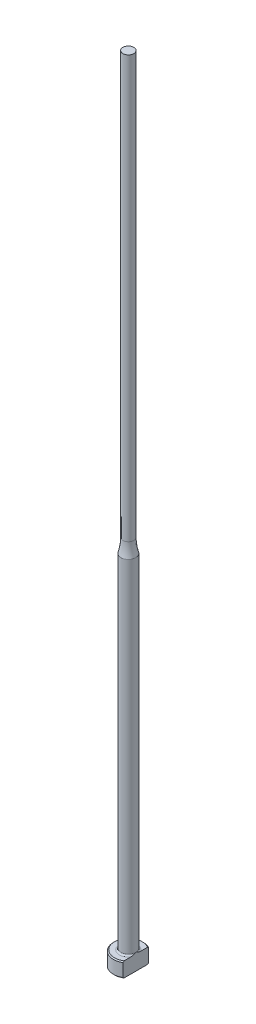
ISO-10303-21;
HEADER;
FILE_DESCRIPTION(('STEP AP214'),'2;1');
FILE_NAME('part.step','',(''),(''),'','','');
FILE_SCHEMA(('AUTOMOTIVE_DESIGN { 1 0 10303 214 1 1 1 1 }'));
ENDSEC;
DATA;
#1=APPLICATION_CONTEXT('core data for automotive mechanical design processes');
#2=APPLICATION_PROTOCOL_DEFINITION('international standard','automotive_design',2000,#1);
#3=PRODUCT_CONTEXT('',#1,'mechanical');
#4=PRODUCT('Part','Part','',(#3));
#5=PRODUCT_RELATED_PRODUCT_CATEGORY('part','',(#4));
#6=PRODUCT_DEFINITION_FORMATION('','',#4);
#7=PRODUCT_DEFINITION_CONTEXT('part definition',#1,'design');
#8=PRODUCT_DEFINITION('design','',#6,#7);
#9=PRODUCT_DEFINITION_SHAPE('','',#8);
#10=(LENGTH_UNIT() NAMED_UNIT(*) SI_UNIT(.MILLI.,.METRE.));
#11=(NAMED_UNIT(*) PLANE_ANGLE_UNIT() SI_UNIT($,.RADIAN.));
#12=(NAMED_UNIT(*) SI_UNIT($,.STERADIAN.) SOLID_ANGLE_UNIT());
#13=UNCERTAINTY_MEASURE_WITH_UNIT(LENGTH_MEASURE(1.E-05),#10,'distance_accuracy_value','');
#14=(GEOMETRIC_REPRESENTATION_CONTEXT(3) GLOBAL_UNCERTAINTY_ASSIGNED_CONTEXT((#13)) GLOBAL_UNIT_ASSIGNED_CONTEXT((#10,
#11,#12)) REPRESENTATION_CONTEXT('',''));
#15=CARTESIAN_POINT('',(0.,0.,0.));
#16=DIRECTION('',(0.,0.,1.));
#17=DIRECTION('',(1.,0.,0.));
#18=AXIS2_PLACEMENT_3D('',#15,#16,#17);
#19=CARTESIAN_POINT('',(-2.99999999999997,3.,0.));
#20=DIRECTION('',(0.,1.,0.));
#21=DIRECTION('',(0.,0.,1.));
#22=AXIS2_PLACEMENT_3D('',#19,#20,#21);
#23=PLANE('',#22);
#24=CARTESIAN_POINT('',(0.,3.,0.));
#25=DIRECTION('',(0.,1.,0.));
#26=DIRECTION('',(0.,0.,1.));
#27=AXIS2_PLACEMENT_3D('',#24,#25,#26);
#28=CIRCLE('',#27,2.79999999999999);
#29=CARTESIAN_POINT('',(1.49999999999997,3.,-2.36431808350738));
#30=VERTEX_POINT('',#29);
#31=CARTESIAN_POINT('',(1.49999999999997,3.,2.36431808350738));
#32=VERTEX_POINT('',#31);
#33=EDGE_CURVE('E187',#30,#32,#28,.T.);
#34=ORIENTED_EDGE('',*,*,#33,.T.);
#35=DIRECTION('',(0.,0.,-1.));
#36=VECTOR('',#35,1.);
#37=CARTESIAN_POINT('',(1.49999999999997,3.,0.));
#38=LINE('',#37,#36);
#39=CARTESIAN_POINT('',(1.49999999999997,3.00000000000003,0.99498743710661));
#40=VERTEX_POINT('',#39);
#41=EDGE_CURVE('E57',#32,#40,#38,.T.);
#42=ORIENTED_EDGE('',*,*,#41,.T.);
#43=CARTESIAN_POINT('',(0.,3.,0.));
#44=DIRECTION('',(0.,1.,0.));
#45=DIRECTION('',(0.,0.,1.));
#46=AXIS2_PLACEMENT_3D('',#43,#44,#45);
#47=CIRCLE('',#46,1.79999999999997);
#48=CARTESIAN_POINT('',(1.49999999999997,3.00000000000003,-0.994987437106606));
#49=VERTEX_POINT('',#48);
#50=EDGE_CURVE('E108',#40,#49,#47,.F.);
#51=ORIENTED_EDGE('',*,*,#50,.T.);
#52=EDGE_CURVE('E137',#49,#30,#38,.T.);
#53=ORIENTED_EDGE('',*,*,#52,.T.);
#54=EDGE_LOOP('',(#34,#42,#51,#53));
#55=FACE_BOUND('',#54,.T.);
#56=ADVANCED_FACE('F32',(#55),#23,.T.);
#57=CARTESIAN_POINT('',(0.,259.958771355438,0.));
#58=DIRECTION('',(0.,1.,0.));
#59=DIRECTION('',(0.,0.,1.));
#60=AXIS2_PLACEMENT_3D('',#57,#58,#59);
#61=CYLINDRICAL_SURFACE('',#60,2.99999999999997);
#62=CARTESIAN_POINT('',(0.,2.80000000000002,0.));
#63=DIRECTION('',(0.,1.,0.));
#64=DIRECTION('',(0.,0.,1.));
#65=AXIS2_PLACEMENT_3D('',#62,#63,#64);
#66=CIRCLE('',#65,2.99999999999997);
#67=CARTESIAN_POINT('',(1.49999999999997,2.80000000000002,2.5980762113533));
#68=VERTEX_POINT('',#67);
#69=CARTESIAN_POINT('',(1.49999999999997,2.80000000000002,-2.5980762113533));
#70=VERTEX_POINT('',#69);
#71=EDGE_CURVE('E105',#68,#70,#66,.F.);
#72=ORIENTED_EDGE('',*,*,#71,.T.);
#73=DIRECTION('',(0.,-1.,0.));
#74=VECTOR('',#73,1.);
#75=CARTESIAN_POINT('',(1.49999999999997,160.,-2.5980762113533));
#76=LINE('',#75,#74);
#77=CARTESIAN_POINT('',(1.49999999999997,0.200000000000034,-2.5980762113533));
#78=VERTEX_POINT('',#77);
#79=EDGE_CURVE('E193',#70,#78,#76,.T.);
#80=ORIENTED_EDGE('',*,*,#79,.T.);
#81=CARTESIAN_POINT('',(0.,0.200000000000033,0.));
#82=DIRECTION('',(0.,-1.,0.));
#83=DIRECTION('',(0.,0.,-1.));
#84=AXIS2_PLACEMENT_3D('',#81,#82,#83);
#85=CIRCLE('',#84,2.99999999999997);
#86=CARTESIAN_POINT('',(1.49999999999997,0.200000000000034,2.5980762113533));
#87=VERTEX_POINT('',#86);
#88=EDGE_CURVE('E100',#78,#87,#85,.F.);
#89=ORIENTED_EDGE('',*,*,#88,.T.);
#90=DIRECTION('',(0.,-1.,0.));
#91=VECTOR('',#90,1.);
#92=CARTESIAN_POINT('',(1.49999999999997,160.,2.5980762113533));
#93=LINE('',#92,#91);
#94=EDGE_CURVE('E93',#68,#87,#93,.T.);
#95=ORIENTED_EDGE('',*,*,#94,.F.);
#96=EDGE_LOOP('',(#72,#80,#89,#95));
#97=FACE_BOUND('',#96,.T.);
#98=ADVANCED_FACE('F158',(#97),#61,.T.);
#99=CARTESIAN_POINT('',(0.,0.,0.));
#100=DIRECTION('',(0.,-1.,0.));
#101=DIRECTION('',(0.,0.,-1.));
#102=AXIS2_PLACEMENT_3D('',#99,#100,#101);
#103=PLANE('',#102);
#104=CARTESIAN_POINT('',(0.,0.,0.));
#105=DIRECTION('',(0.,-1.,0.));
#106=DIRECTION('',(0.,0.,-1.));
#107=AXIS2_PLACEMENT_3D('',#104,#105,#106);
#108=CIRCLE('',#107,2.79999999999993);
#109=CARTESIAN_POINT('',(1.49999999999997,0.,2.36431808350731));
#110=VERTEX_POINT('',#109);
#111=CARTESIAN_POINT('',(1.49999999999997,0.,-2.36431808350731));
#112=VERTEX_POINT('',#111);
#113=EDGE_CURVE('E98',#110,#112,#108,.T.);
#114=ORIENTED_EDGE('',*,*,#113,.T.);
#115=DIRECTION('',(0.,0.,1.));
#116=VECTOR('',#115,1.);
#117=CARTESIAN_POINT('',(1.49999999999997,0.,-2.5980762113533));
#118=LINE('',#117,#116);
#119=EDGE_CURVE('E83',#112,#110,#118,.T.);
#120=ORIENTED_EDGE('',*,*,#119,.T.);
#121=EDGE_LOOP('',(#114,#120));
#122=FACE_BOUND('',#121,.T.);
#123=ADVANCED_FACE('F103',(#122),#103,.T.);
#124=CARTESIAN_POINT('',(0.,3.,0.));
#125=DIRECTION('',(0.,-1.,0.));
#126=DIRECTION('',(0.,0.,-1.));
#127=AXIS2_PLACEMENT_3D('',#124,#125,#126);
#128=CONICAL_SURFACE('',#127,2.79999999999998,0.785398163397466);
#129=ORIENTED_EDGE('',*,*,#71,.F.);
#130=CARTESIAN_POINT('',(1.49999999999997,-0.111741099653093,5.71827621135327));
#131=CARTESIAN_POINT('',(1.49999999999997,0.0136183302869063,5.58866816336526));
#132=CARTESIAN_POINT('',(1.49999999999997,0.138843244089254,5.45892957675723));
#133=CARTESIAN_POINT('',(1.49999999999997,0.388944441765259,5.19911365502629));
#134=CARTESIAN_POINT('',(1.49999999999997,0.513820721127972,5.06903631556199));
#135=CARTESIAN_POINT('',(1.49999999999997,0.763205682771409,4.80840180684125));
#136=CARTESIAN_POINT('',(1.49999999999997,0.887714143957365,4.67784442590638));
#137=CARTESIAN_POINT('',(1.49999999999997,1.13618059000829,4.41620813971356));
#138=CARTESIAN_POINT('',(1.49999999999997,1.26013857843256,4.28512923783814));
#139=CARTESIAN_POINT('',(1.49999999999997,1.50488975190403,4.02490837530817));
#140=CARTESIAN_POINT('',(1.49999999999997,1.6256969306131,3.89577958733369));
#141=CARTESIAN_POINT('',(1.49999999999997,1.86640694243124,3.63668213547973));
#142=CARTESIAN_POINT('',(1.49999999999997,1.98630978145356,3.50671347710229));
#143=CARTESIAN_POINT('',(1.49999999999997,2.22486033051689,3.24567921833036));
#144=CARTESIAN_POINT('',(1.49999999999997,2.34350830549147,3.11461386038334));
#145=CARTESIAN_POINT('',(1.49999999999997,2.57907716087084,2.85094268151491));
#146=CARTESIAN_POINT('',(1.49999999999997,2.69599811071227,2.71833692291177));
#147=CARTESIAN_POINT('',(1.49999999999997,2.88262371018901,2.50255231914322));
#148=CARTESIAN_POINT('',(1.49999999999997,2.95312454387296,2.42006293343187));
#149=CARTESIAN_POINT('',(1.49999999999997,3.0928709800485,2.25401084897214));
#150=CARTESIAN_POINT('',(1.49999999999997,3.16211645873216,2.17044804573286));
#151=CARTESIAN_POINT('',(1.49999999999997,3.29964684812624,2.00105967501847));
#152=CARTESIAN_POINT('',(1.49999999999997,3.36791386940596,1.91521952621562));
#153=CARTESIAN_POINT('',(1.49999999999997,3.50205840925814,1.74171392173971));
#154=CARTESIAN_POINT('',(1.49999999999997,3.56793649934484,1.65404891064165));
#155=CARTESIAN_POINT('',(1.49999999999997,3.69728151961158,1.47490236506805));
#156=CARTESIAN_POINT('',(1.49999999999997,3.76069661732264,1.38338308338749));
#157=CARTESIAN_POINT('',(1.49999999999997,3.8823953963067,1.19675661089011));
#158=CARTESIAN_POINT('',(1.49999999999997,3.94067201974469,1.10164473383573));
#159=CARTESIAN_POINT('',(1.49999999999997,4.04841325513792,0.908008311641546));
#160=CARTESIAN_POINT('',(1.49999999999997,4.0979780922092,0.809540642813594));
#161=CARTESIAN_POINT('',(1.49999999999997,4.18432188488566,0.607192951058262));
#162=CARTESIAN_POINT('',(1.49999999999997,4.22114374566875,0.503332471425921));
#163=CARTESIAN_POINT('',(1.49999999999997,4.26099935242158,0.347577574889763));
#164=CARTESIAN_POINT('',(1.49999999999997,4.27157029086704,0.297609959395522));
#165=CARTESIAN_POINT('',(1.49999999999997,4.28794860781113,0.196885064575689));
#166=CARTESIAN_POINT('',(1.49999999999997,4.29375640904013,0.146127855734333));
#167=CARTESIAN_POINT('',(1.49999999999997,4.30019707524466,0.0444388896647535));
#168=CARTESIAN_POINT('',(1.49999999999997,4.30084594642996,-0.00649183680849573));
#169=CARTESIAN_POINT('',(1.49999999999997,4.29696416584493,-0.108155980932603));
#170=CARTESIAN_POINT('',(1.49999999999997,4.29243308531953,-0.15888938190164));
#171=CARTESIAN_POINT('',(1.49999999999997,4.27856915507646,-0.259234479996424));
#172=CARTESIAN_POINT('',(1.49999999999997,4.26927821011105,-0.30885208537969));
#173=CARTESIAN_POINT('',(1.49999999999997,4.24647108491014,-0.407110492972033));
#174=CARTESIAN_POINT('',(1.49999999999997,4.2329532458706,-0.455750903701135));
#175=CARTESIAN_POINT('',(1.49999999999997,4.20226175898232,-0.552149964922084));
#176=CARTESIAN_POINT('',(1.49999999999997,4.18506801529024,-0.599902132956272));
#177=CARTESIAN_POINT('',(1.49999999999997,4.14771387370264,-0.694205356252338));
#178=CARTESIAN_POINT('',(1.49999999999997,4.1275540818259,-0.740756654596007));
#179=CARTESIAN_POINT('',(1.49999999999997,4.06327696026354,-0.879166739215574));
#180=CARTESIAN_POINT('',(1.49999999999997,4.01551721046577,-0.969329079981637));
#181=CARTESIAN_POINT('',(1.49999999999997,3.91367909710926,-1.1460431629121));
#182=CARTESIAN_POINT('',(1.49999999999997,3.85959300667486,-1.23259031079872));
#183=CARTESIAN_POINT('',(1.49999999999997,3.74697968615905,-1.40321348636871));
#184=CARTESIAN_POINT('',(1.49999999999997,3.68843573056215,-1.48727838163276));
#185=CARTESIAN_POINT('',(1.49999999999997,3.56843845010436,-1.65322187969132));
#186=CARTESIAN_POINT('',(1.49999999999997,3.50698656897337,-1.73510153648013));
#187=CARTESIAN_POINT('',(1.49999999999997,3.38115673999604,-1.89829823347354));
#188=CARTESIAN_POINT('',(1.49999999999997,3.31675092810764,-1.97959369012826));
#189=CARTESIAN_POINT('',(1.49999999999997,3.18634068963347,-2.14090082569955));
#190=CARTESIAN_POINT('',(1.49999999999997,3.12033609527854,-2.22091236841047));
#191=CARTESIAN_POINT('',(1.49999999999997,2.92086431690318,-2.45906508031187));
#192=CARTESIAN_POINT('',(1.49999999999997,2.78562663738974,-2.61572090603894));
#193=CARTESIAN_POINT('',(1.49999999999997,2.53554498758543,-2.90006295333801));
#194=CARTESIAN_POINT('',(1.49999999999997,2.42114543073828,-3.02814382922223));
#195=CARTESIAN_POINT('',(1.49999999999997,2.19093557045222,-3.28303767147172));
#196=CARTESIAN_POINT('',(1.49999999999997,2.07512522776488,-3.40985060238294));
#197=CARTESIAN_POINT('',(1.49999999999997,1.72597067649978,-3.7891384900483));
#198=CARTESIAN_POINT('',(1.49999999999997,1.49111760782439,-4.04022177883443));
#199=CARTESIAN_POINT('',(1.49999999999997,1.02882478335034,-4.52992803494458));
#200=CARTESIAN_POINT('',(1.49999999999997,0.801477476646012,-4.76863870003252));
#201=CARTESIAN_POINT('',(1.49999999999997,0.459548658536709,-5.12558036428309));
#202=CARTESIAN_POINT('',(1.49999999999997,0.345484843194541,-5.2443077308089));
#203=CARTESIAN_POINT('',(1.49999999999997,0.117071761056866,-5.48148573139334));
#204=CARTESIAN_POINT('',(1.49999999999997,0.00272249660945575,-5.59993636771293));
#205=CARTESIAN_POINT('',(1.49999999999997,-0.111741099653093,-5.71827621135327));
#206=B_SPLINE_CURVE_WITH_KNOTS('',3,(#130,#131,#132,#133,#134,#135,#136,#137,#138,#139,#140,
#141,#142,#143,#144,#145,#146,#147,#148,#149,#150,#151,#152,#153,#154,#155,#156,#157,#158,#159,
#160,#161,#162,#163,#164,#165,#166,#167,#168,#169,#170,#171,#172,#173,#174,#175,#176,#177,#178,
#179,#180,#181,#182,#183,#184,#185,#186,#187,#188,#189,#190,#191,#192,#193,#194,#195,#196,#197,
#198,#199,#200,#201,#202,#203,#204,#205),.UNSPECIFIED.,.F.,.F.,(4,2,2,2,2,2,2,2,2,2,2,2,2,2,2,2,
2,2,2,2,2,2,2,2,2,2,2,2,2,2,2,2,2,2,2,2,2,4),(0.,0.540943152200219,1.08189327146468,
1.62312052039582,2.16434426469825,2.69482920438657,3.22531067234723,3.75567781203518,
4.2860235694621,4.61155053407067,4.93710943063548,5.2661094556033,5.59503024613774,
5.92894782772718,6.26331713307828,6.59354403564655,6.92264800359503,7.0756747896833,
7.22868799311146,7.38122626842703,7.53377717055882,7.68500755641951,7.83629736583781,
7.98843643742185,8.14054446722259,8.44618799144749,8.75220879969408,9.05944044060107,
9.36652111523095,9.67764287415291,9.98879742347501,10.6095925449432,11.1247803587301,
11.6399825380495,12.6713544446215,13.6603005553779,14.1542238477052,14.6481430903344),.UNSPECIFIED.);
#207=EDGE_CURVE('E136',#68,#32,#206,.T.);
#208=ORIENTED_EDGE('',*,*,#207,.T.);
#209=ORIENTED_EDGE('',*,*,#33,.F.);
#210=EDGE_CURVE('E128',#30,#70,#206,.T.);
#211=ORIENTED_EDGE('',*,*,#210,.T.);
#212=EDGE_LOOP('',(#129,#208,#209,#211));
#213=FACE_BOUND('',#212,.T.);
#214=ADVANCED_FACE('F144',(#213),#128,.T.);
#215=CARTESIAN_POINT('',(0.,0.200000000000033,0.));
#216=DIRECTION('',(0.,1.,0.));
#217=DIRECTION('',(0.,0.,1.));
#218=AXIS2_PLACEMENT_3D('',#215,#216,#217);
#219=CONICAL_SURFACE('',#218,2.99999999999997,0.785398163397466);
#220=ORIENTED_EDGE('',*,*,#88,.F.);
#221=CARTESIAN_POINT('',(1.49999999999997,3.11174109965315,-5.71827621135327));
#222=CARTESIAN_POINT('',(1.49999999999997,2.98638166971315,-5.58866816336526));
#223=CARTESIAN_POINT('',(1.49999999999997,2.8611567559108,-5.45892957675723));
#224=CARTESIAN_POINT('',(1.49999999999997,2.6110555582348,-5.19911365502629));
#225=CARTESIAN_POINT('',(1.49999999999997,2.48617927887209,-5.06903631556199));
#226=CARTESIAN_POINT('',(1.49999999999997,2.23679431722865,-4.80840180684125));
#227=CARTESIAN_POINT('',(1.49999999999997,2.11228585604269,-4.67784442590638));
#228=CARTESIAN_POINT('',(1.49999999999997,1.86381940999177,-4.41620813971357));
#229=CARTESIAN_POINT('',(1.49999999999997,1.7398614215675,-4.28512923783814));
#230=CARTESIAN_POINT('',(1.49999999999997,1.49511024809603,-4.02490837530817));
#231=CARTESIAN_POINT('',(1.49999999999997,1.37430306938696,-3.89577958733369));
#232=CARTESIAN_POINT('',(1.49999999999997,1.13359305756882,-3.63668213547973));
#233=CARTESIAN_POINT('',(1.49999999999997,1.0136902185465,-3.50671347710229));
#234=CARTESIAN_POINT('',(1.49999999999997,0.775139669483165,-3.24567921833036));
#235=CARTESIAN_POINT('',(1.49999999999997,0.656491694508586,-3.11461386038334));
#236=CARTESIAN_POINT('',(1.49999999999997,0.420922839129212,-2.85094268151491));
#237=CARTESIAN_POINT('',(1.49999999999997,0.304001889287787,-2.71833692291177));
#238=CARTESIAN_POINT('',(1.49999999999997,0.117376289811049,-2.50255231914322));
#239=CARTESIAN_POINT('',(1.49999999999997,0.0468754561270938,-2.42006293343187));
#240=CARTESIAN_POINT('',(1.49999999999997,-0.0928709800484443,-2.25401084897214));
#241=CARTESIAN_POINT('',(1.49999999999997,-0.162116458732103,-2.17044804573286));
#242=CARTESIAN_POINT('',(1.49999999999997,-0.299646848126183,-2.00105967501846));
#243=CARTESIAN_POINT('',(1.49999999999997,-0.367913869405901,-1.91521952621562));
#244=CARTESIAN_POINT('',(1.49999999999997,-0.502058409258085,-1.74171392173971));
#245=CARTESIAN_POINT('',(1.49999999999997,-0.567936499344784,-1.65404891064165));
#246=CARTESIAN_POINT('',(1.49999999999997,-0.697281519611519,-1.47490236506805));
#247=CARTESIAN_POINT('',(1.49999999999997,-0.760696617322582,-1.38338308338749));
#248=CARTESIAN_POINT('',(1.49999999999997,-0.882395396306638,-1.19675661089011));
#249=CARTESIAN_POINT('',(1.49999999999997,-0.940672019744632,-1.10164473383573));
#250=CARTESIAN_POINT('',(1.49999999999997,-1.04841325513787,-0.908008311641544));
#251=CARTESIAN_POINT('',(1.49999999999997,-1.09797809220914,-0.809540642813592));
#252=CARTESIAN_POINT('',(1.49999999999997,-1.1843218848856,-0.60719295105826));
#253=CARTESIAN_POINT('',(1.49999999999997,-1.22114374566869,-0.503332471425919));
#254=CARTESIAN_POINT('',(1.49999999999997,-1.26099935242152,-0.347577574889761));
#255=CARTESIAN_POINT('',(1.49999999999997,-1.27157029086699,-0.29760995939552));
#256=CARTESIAN_POINT('',(1.49999999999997,-1.28794860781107,-0.196885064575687));
#257=CARTESIAN_POINT('',(1.49999999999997,-1.29375640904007,-0.146127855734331));
#258=CARTESIAN_POINT('',(1.49999999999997,-1.30019707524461,-0.0444388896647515));
#259=CARTESIAN_POINT('',(1.49999999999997,-1.3008459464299,0.00649183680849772));
#260=CARTESIAN_POINT('',(1.49999999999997,-1.29696416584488,0.108155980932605));
#261=CARTESIAN_POINT('',(1.49999999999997,-1.29243308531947,0.158889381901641));
#262=CARTESIAN_POINT('',(1.49999999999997,-1.2785691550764,0.259234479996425));
#263=CARTESIAN_POINT('',(1.49999999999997,-1.26927821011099,0.308852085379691));
#264=CARTESIAN_POINT('',(1.49999999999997,-1.24647108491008,0.407110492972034));
#265=CARTESIAN_POINT('',(1.49999999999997,-1.23295324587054,0.455750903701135));
#266=CARTESIAN_POINT('',(1.49999999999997,-1.20226175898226,0.552149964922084));
#267=CARTESIAN_POINT('',(1.49999999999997,-1.18506801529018,0.599902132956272));
#268=CARTESIAN_POINT('',(1.49999999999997,-1.14771387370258,0.694205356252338));
#269=CARTESIAN_POINT('',(1.49999999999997,-1.12755408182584,0.740756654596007));
#270=CARTESIAN_POINT('',(1.49999999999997,-1.06327696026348,0.879166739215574));
#271=CARTESIAN_POINT('',(1.49999999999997,-1.01551721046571,0.969329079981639));
#272=CARTESIAN_POINT('',(1.49999999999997,-0.913679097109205,1.1460431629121));
#273=CARTESIAN_POINT('',(1.49999999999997,-0.8595930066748,1.23259031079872));
#274=CARTESIAN_POINT('',(1.49999999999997,-0.746979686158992,1.40321348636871));
#275=CARTESIAN_POINT('',(1.49999999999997,-0.688435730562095,1.48727838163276));
#276=CARTESIAN_POINT('',(1.49999999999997,-0.568438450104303,1.65322187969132));
#277=CARTESIAN_POINT('',(1.49999999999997,-0.506986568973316,1.73510153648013));
#278=CARTESIAN_POINT('',(1.49999999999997,-0.381156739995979,1.89829823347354));
#279=CARTESIAN_POINT('',(1.49999999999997,-0.316750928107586,1.97959369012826));
#280=CARTESIAN_POINT('',(1.49999999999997,-0.186340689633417,2.14090082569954));
#281=CARTESIAN_POINT('',(1.49999999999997,-0.120336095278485,2.22091236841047));
#282=CARTESIAN_POINT('',(1.49999999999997,0.0791356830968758,2.45906508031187));
#283=CARTESIAN_POINT('',(1.49999999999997,0.214373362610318,2.61572090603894));
#284=CARTESIAN_POINT('',(1.49999999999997,0.46445501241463,2.90006295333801));
#285=CARTESIAN_POINT('',(1.49999999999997,0.578854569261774,3.02814382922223));
#286=CARTESIAN_POINT('',(1.49999999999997,0.809064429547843,3.28303767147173));
#287=CARTESIAN_POINT('',(1.49999999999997,0.924874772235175,3.40985060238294));
#288=CARTESIAN_POINT('',(1.49999999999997,1.27402932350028,3.78913849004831));
#289=CARTESIAN_POINT('',(1.49999999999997,1.50888239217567,4.04022177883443));
#290=CARTESIAN_POINT('',(1.49999999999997,1.97117521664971,4.52992803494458));
#291=CARTESIAN_POINT('',(1.49999999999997,2.19852252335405,4.76863870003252));
#292=CARTESIAN_POINT('',(1.49999999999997,2.54045134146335,5.12558036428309));
#293=CARTESIAN_POINT('',(1.49999999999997,2.65451515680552,5.2443077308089));
#294=CARTESIAN_POINT('',(1.49999999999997,2.88292823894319,5.48148573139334));
#295=CARTESIAN_POINT('',(1.49999999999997,2.9972775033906,5.59993636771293));
#296=CARTESIAN_POINT('',(1.49999999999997,3.11174109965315,5.71827621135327));
#297=B_SPLINE_CURVE_WITH_KNOTS('',3,(#221,#222,#223,#224,#225,#226,#227,#228,#229,#230,#231,
#232,#233,#234,#235,#236,#237,#238,#239,#240,#241,#242,#243,#244,#245,#246,#247,#248,#249,#250,
#251,#252,#253,#254,#255,#256,#257,#258,#259,#260,#261,#262,#263,#264,#265,#266,#267,#268,#269,
#270,#271,#272,#273,#274,#275,#276,#277,#278,#279,#280,#281,#282,#283,#284,#285,#286,#287,#288,
#289,#290,#291,#292,#293,#294,#295,#296),.UNSPECIFIED.,.F.,.F.,(4,2,2,2,2,2,2,2,2,2,2,2,2,2,2,2,
2,2,2,2,2,2,2,2,2,2,2,2,2,2,2,2,2,2,2,2,2,4),(0.,0.540943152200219,1.08189327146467,
1.62312052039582,2.16434426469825,2.69482920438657,3.22531067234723,3.75567781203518,
4.28602356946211,4.61155053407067,4.93710943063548,5.2661094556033,5.59503024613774,
5.92894782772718,6.26331713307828,6.59354403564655,6.92264800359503,7.0756747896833,
7.22868799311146,7.38122626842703,7.53377717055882,7.68500755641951,7.83629736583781,
7.98843643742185,8.14054446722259,8.4461879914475,8.75220879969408,9.05944044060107,
9.36652111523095,9.6776428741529,9.98879742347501,10.6095925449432,11.1247803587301,
11.6399825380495,12.6713544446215,13.6603005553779,14.1542238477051,14.6481430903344),.UNSPECIFIED.);
#298=EDGE_CURVE('E86',#78,#112,#297,.T.);
#299=ORIENTED_EDGE('',*,*,#298,.T.);
#300=ORIENTED_EDGE('',*,*,#113,.F.);
#301=EDGE_CURVE('E89',#110,#87,#297,.T.);
#302=ORIENTED_EDGE('',*,*,#301,.T.);
#303=EDGE_LOOP('',(#220,#299,#300,#302));
#304=FACE_BOUND('',#303,.T.);
#305=ADVANCED_FACE('F97',(#304),#219,.T.);
#306=CARTESIAN_POINT('',(0.,3.30000000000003,0.));
#307=DIRECTION('',(0.,1.,0.));
#308=DIRECTION('',(0.,0.,1.));
#309=AXIS2_PLACEMENT_3D('',#306,#307,#308);
#310=TOROIDAL_SURFACE('',#309,1.79999999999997,0.3);
#311=CARTESIAN_POINT('',(1.49999999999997,3.30000000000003,0.));
#312=CARTESIAN_POINT('',(1.49999999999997,3.300000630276,3.41555678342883E-12));
#313=CARTESIAN_POINT('',(1.49999999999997,3.30000126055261,-1.15373640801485E-07));
#314=CARTESIAN_POINT('',(1.49999999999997,3.3000024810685,-4.90631575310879E-07));
#315=CARTESIAN_POINT('',(1.49999999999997,3.30000307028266,-7.53296670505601E-07));
#316=CARTESIAN_POINT('',(1.49999999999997,3.30000424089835,-1.38757096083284E-06));
#317=CARTESIAN_POINT('',(1.49999999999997,3.300004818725,-1.76563001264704E-06));
#318=CARTESIAN_POINT('',(1.49999999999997,3.30000591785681,-2.58768006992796E-06));
#319=CARTESIAN_POINT('',(1.49999999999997,3.30000643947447,-3.03127014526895E-06));
#320=CARTESIAN_POINT('',(1.49999999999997,3.30000815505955,-4.60021967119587E-06));
#321=CARTESIAN_POINT('',(1.49999999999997,3.30000927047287,-5.8124152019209E-06));
#322=CARTESIAN_POINT('',(1.49999999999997,3.30001128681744,-8.33989413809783E-06));
#323=CARTESIAN_POINT('',(1.49999999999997,3.30001219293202,-9.65128157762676E-06));
#324=CARTESIAN_POINT('',(1.49999999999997,3.30001551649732,-1.46782505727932E-05));
#325=CARTESIAN_POINT('',(1.49999999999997,3.30001775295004,-1.8517976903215E-05));
#326=CARTESIAN_POINT('',(1.49999999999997,3.30002148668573,-2.61616194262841E-05));
#327=CARTESIAN_POINT('',(1.49999999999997,3.30002302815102,-2.99447742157E-05));
#328=CARTESIAN_POINT('',(1.49999999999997,3.30002943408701,-4.58003743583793E-05));
#329=CARTESIAN_POINT('',(1.49999999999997,3.3000341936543,-5.79079078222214E-05));
#330=CARTESIAN_POINT('',(1.49999999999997,3.30004197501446,-8.07263755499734E-05));
#331=CARTESIAN_POINT('',(1.49999999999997,3.30004514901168,-9.13834709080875E-05));
#332=CARTESIAN_POINT('',(1.49999999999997,3.30006989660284,-0.000167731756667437));
#333=CARTESIAN_POINT('',(1.49999999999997,3.30010092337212,-0.000229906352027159));
#334=CARTESIAN_POINT('',(1.49999999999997,3.30021632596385,-0.000470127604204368));
#335=CARTESIAN_POINT('',(1.49999999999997,3.30029368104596,-0.000650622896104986));
#336=CARTESIAN_POINT('',(1.49999999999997,3.30059619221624,-0.00134589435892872));
#337=CARTESIAN_POINT('',(1.49999999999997,3.30082870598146,-0.00185814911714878));
#338=CARTESIAN_POINT('',(1.49999999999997,3.30176696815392,-0.00393547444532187));
#339=CARTESIAN_POINT('',(1.49999999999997,3.30246445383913,-0.00550332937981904));
#340=CARTESIAN_POINT('',(1.49999999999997,3.31426785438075,-0.0320229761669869));
#341=CARTESIAN_POINT('',(1.49999999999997,3.32544800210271,-0.0569503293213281));
#342=CARTESIAN_POINT('',(1.49999999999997,3.34725700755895,-0.105984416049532));
#343=CARTESIAN_POINT('',(1.49999999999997,3.35789134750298,-0.130088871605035));
#344=CARTESIAN_POINT('',(1.49999999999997,3.38015321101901,-0.181096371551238));
#345=CARTESIAN_POINT('',(1.49999999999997,3.39175804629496,-0.208009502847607));
#346=CARTESIAN_POINT('',(1.49999999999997,3.41469034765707,-0.262264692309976));
#347=CARTESIAN_POINT('',(1.49999999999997,3.42601398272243,-0.289608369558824));
#348=CARTESIAN_POINT('',(1.49999999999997,3.45363212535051,-0.35820378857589));
#349=CARTESIAN_POINT('',(1.49999999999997,3.46959026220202,-0.39959288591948));
#350=CARTESIAN_POINT('',(1.49999999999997,3.49940505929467,-0.482097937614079));
#351=CARTESIAN_POINT('',(1.49999999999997,3.51330033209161,-0.523199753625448));
#352=CARTESIAN_POINT('',(1.49999999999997,3.53552507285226,-0.595497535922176));
#353=CARTESIAN_POINT('',(1.49999999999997,3.54436834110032,-0.626532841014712));
#354=CARTESIAN_POINT('',(1.49999999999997,3.56052427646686,-0.6891760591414));
#355=CARTESIAN_POINT('',(1.49999999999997,3.5678279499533,-0.720786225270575));
#356=CARTESIAN_POINT('',(1.49999999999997,3.5875075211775,-0.819524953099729));
#357=CARTESIAN_POINT('',(1.49999999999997,3.59661044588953,-0.88742909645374));
#358=CARTESIAN_POINT('',(1.49999999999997,3.60059842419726,-0.991180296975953));
#359=CARTESIAN_POINT('',(1.49999999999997,3.60019840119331,-1.02684364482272));
#360=CARTESIAN_POINT('',(1.49999999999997,3.59497085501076,-1.097505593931));
#361=CARTESIAN_POINT('',(1.49999999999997,3.59019295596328,-1.13250716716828));
#362=CARTESIAN_POINT('',(1.49999999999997,3.57687734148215,-1.19353096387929));
#363=CARTESIAN_POINT('',(1.49999999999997,3.56943875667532,-1.21978854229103));
#364=CARTESIAN_POINT('',(1.49999999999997,3.55063748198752,-1.27094658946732));
#365=CARTESIAN_POINT('',(1.49999999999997,3.53927342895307,-1.29584658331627));
#366=CARTESIAN_POINT('',(1.49999999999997,3.51660016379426,-1.33501873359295));
#367=CARTESIAN_POINT('',(1.49999999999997,3.50657738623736,-1.35003296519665));
#368=CARTESIAN_POINT('',(1.49999999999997,3.48437469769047,-1.37837252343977));
#369=CARTESIAN_POINT('',(1.49999999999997,3.47219867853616,-1.39170082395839));
#370=CARTESIAN_POINT('',(1.49999999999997,3.44835614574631,-1.41349417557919));
#371=CARTESIAN_POINT('',(1.49999999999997,3.43709185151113,-1.42239673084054));
#372=CARTESIAN_POINT('',(1.49999999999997,3.41325256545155,-1.43825467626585));
#373=CARTESIAN_POINT('',(1.49999999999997,3.40067804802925,-1.44521076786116));
#374=CARTESIAN_POINT('',(1.49999999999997,3.37433767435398,-1.45677158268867));
#375=CARTESIAN_POINT('',(1.49999999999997,3.36056203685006,-1.46135438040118));
#376=CARTESIAN_POINT('',(1.49999999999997,3.33237324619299,-1.46767730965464));
#377=CARTESIAN_POINT('',(1.49999999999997,3.31796076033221,-1.46942034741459));
#378=CARTESIAN_POINT('',(1.49999999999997,3.29122479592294,-1.4698720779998));
#379=CARTESIAN_POINT('',(1.49999999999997,3.27890664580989,-1.468990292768));
#380=CARTESIAN_POINT('',(1.49999999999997,3.25461019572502,-1.4651157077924));
#381=CARTESIAN_POINT('',(1.49999999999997,3.2426318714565,-1.46212305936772));
#382=CARTESIAN_POINT('',(1.49999999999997,3.21959683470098,-1.4543117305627));
#383=CARTESIAN_POINT('',(1.49999999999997,3.20852542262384,-1.44953579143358));
#384=CARTESIAN_POINT('',(1.49999999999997,3.18721125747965,-1.43840957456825));
#385=CARTESIAN_POINT('',(1.49999999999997,3.1769687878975,-1.43205876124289));
#386=CARTESIAN_POINT('',(1.49999999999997,3.15325976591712,-1.41506353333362));
#387=CARTESIAN_POINT('',(1.49999999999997,3.14027750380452,-1.40374235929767));
#388=CARTESIAN_POINT('',(1.49999999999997,3.11630720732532,-1.37914825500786));
#389=CARTESIAN_POINT('',(1.49999999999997,3.10532420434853,-1.36587054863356));
#390=CARTESIAN_POINT('',(1.49999999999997,3.08100891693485,-1.33197272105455));
#391=CARTESIAN_POINT('',(1.49999999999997,3.06867625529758,-1.31063843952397));
#392=CARTESIAN_POINT('',(1.49999999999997,3.04751867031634,-1.26637455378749));
#393=CARTESIAN_POINT('',(1.49999999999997,3.03869240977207,-1.24344556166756));
#394=CARTESIAN_POINT('',(1.49999999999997,3.01978360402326,-1.18316534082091));
#395=CARTESIAN_POINT('',(1.49999999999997,3.01191472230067,-1.14512623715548));
#396=CARTESIAN_POINT('',(1.49999999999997,3.00188285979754,-1.06789971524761));
#397=CARTESIAN_POINT('',(1.49999999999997,2.99979735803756,-1.02870374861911));
#398=CARTESIAN_POINT('',(1.49999999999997,3.00021727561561,-0.953160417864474));
#399=CARTESIAN_POINT('',(1.49999999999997,3.00240673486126,-0.916808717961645));
#400=CARTESIAN_POINT('',(1.49999999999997,3.0099643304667,-0.844432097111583));
#401=CARTESIAN_POINT('',(1.49999999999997,3.01533462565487,-0.808407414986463));
#402=CARTESIAN_POINT('',(1.49999999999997,3.02828086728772,-0.738670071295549));
#403=CARTESIAN_POINT('',(1.49999999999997,3.03573028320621,-0.704933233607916));
#404=CARTESIAN_POINT('',(1.49999999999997,3.05243174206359,-0.638128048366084));
#405=CARTESIAN_POINT('',(1.49999999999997,3.06167285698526,-0.605056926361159));
#406=CARTESIAN_POINT('',(1.49999999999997,3.08440652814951,-0.53019513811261));
#407=CARTESIAN_POINT('',(1.49999999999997,3.09836576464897,-0.488547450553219));
#408=CARTESIAN_POINT('',(1.49999999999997,3.1283820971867,-0.404954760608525));
#409=CARTESIAN_POINT('',(1.49999999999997,3.14447968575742,-0.363024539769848));
#410=CARTESIAN_POINT('',(1.49999999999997,3.17238454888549,-0.293508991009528));
#411=CARTESIAN_POINT('',(1.49999999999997,3.18384249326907,-0.265781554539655));
#412=CARTESIAN_POINT('',(1.49999999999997,3.20705854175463,-0.210769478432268));
#413=CARTESIAN_POINT('',(1.49999999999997,3.21881265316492,-0.183483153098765));
#414=CARTESIAN_POINT('',(1.49999999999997,3.24136702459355,-0.131772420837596));
#415=CARTESIAN_POINT('',(1.49999999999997,3.25214361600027,-0.107337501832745));
#416=CARTESIAN_POINT('',(1.49999999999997,3.27424746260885,-0.0576321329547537));
#417=CARTESIAN_POINT('',(1.49999999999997,3.28558038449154,-0.0323640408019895));
#418=CARTESIAN_POINT('',(1.49999999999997,3.29753556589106,-0.00550327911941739));
#419=CARTESIAN_POINT('',(1.49999999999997,3.29823307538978,-0.00393537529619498));
#420=CARTESIAN_POINT('',(1.49999999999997,3.29917134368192,-0.00185803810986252));
#421=CARTESIAN_POINT('',(1.49999999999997,3.29940384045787,-0.00134582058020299));
#422=CARTESIAN_POINT('',(1.49999999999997,3.29970633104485,-0.000650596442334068));
#423=CARTESIAN_POINT('',(1.49999999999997,3.29978368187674,-0.000470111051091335));
#424=CARTESIAN_POINT('',(1.49999999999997,3.29989907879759,-0.000229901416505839));
#425=CARTESIAN_POINT('',(1.49999999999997,3.29993010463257,-0.000167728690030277));
#426=CARTESIAN_POINT('',(1.49999999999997,3.29995485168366,-9.13825689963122E-05));
#427=CARTESIAN_POINT('',(1.49999999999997,3.29995802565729,-8.07256241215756E-05));
#428=CARTESIAN_POINT('',(1.49999999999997,3.29996580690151,-5.79074820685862E-05));
#429=CARTESIAN_POINT('',(1.49999999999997,3.29997056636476,-4.5800119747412E-05));
#430=CARTESIAN_POINT('',(1.49999999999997,3.29997697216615,-2.99447119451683E-05));
#431=CARTESIAN_POINT('',(1.49999999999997,3.2999785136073,-2.61615817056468E-05));
#432=CARTESIAN_POINT('',(1.49999999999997,3.2999822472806,-1.85179845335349E-05));
#433=CARTESIAN_POINT('',(1.49999999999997,3.29998448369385,-1.46782782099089E-05));
#434=CARTESIAN_POINT('',(1.49999999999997,3.2999878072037,-9.65132752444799E-06));
#435=CARTESIAN_POINT('',(1.49999999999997,3.299988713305,-8.33994202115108E-06));
#436=CARTESIAN_POINT('',(1.49999999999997,3.29999072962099,-5.81246426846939E-06));
#437=CARTESIAN_POINT('',(1.49999999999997,3.29999184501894,-4.600267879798E-06));
#438=CARTESIAN_POINT('',(1.49999999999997,3.29999356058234,-3.03131394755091E-06));
#439=CARTESIAN_POINT('',(1.49999999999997,3.29999408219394,-2.58772196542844E-06));
#440=CARTESIAN_POINT('',(1.49999999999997,3.2999951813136,-1.76566701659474E-06));
#441=CARTESIAN_POINT('',(1.49999999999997,3.29999575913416,-1.38760497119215E-06));
#442=CARTESIAN_POINT('',(1.49999999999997,3.29999692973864,-7.53323425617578E-07));
#443=CARTESIAN_POINT('',(1.49999999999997,3.29999751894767,-4.90654189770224E-07));
#444=CARTESIAN_POINT('',(1.49999999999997,3.29999873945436,-1.15386267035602E-07));
#445=CARTESIAN_POINT('',(1.49999999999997,3.29999936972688,-3.41554144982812E-12));
#446=CARTESIAN_POINT('',(1.49999999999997,3.30000000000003,0.));
#447=B_SPLINE_CURVE_WITH_KNOTS('',3,(#311,#312,#313,#314,#315,#316,#317,#318,#319,#320,#321,
#322,#323,#324,#325,#326,#327,#328,#329,#330,#331,#332,#333,#334,#335,#336,#337,#338,#339,#340,
#341,#342,#343,#344,#345,#346,#347,#348,#349,#350,#351,#352,#353,#354,#355,#356,#357,#358,#359,
#360,#361,#362,#363,#364,#365,#366,#367,#368,#369,#370,#371,#372,#373,#374,#375,#376,#377,#378,
#379,#380,#381,#382,#383,#384,#385,#386,#387,#388,#389,#390,#391,#392,#393,#394,#395,#396,#397,
#398,#399,#400,#401,#402,#403,#404,#405,#406,#407,#408,#409,#410,#411,#412,#413,#414,#415,#416,
#417,#418,#419,#420,#421,#422,#423,#424,#425,#426,#427,#428,#429,#430,#431,#432,#433,#434,#435,
#436,#437,#438,#439,#440,#441,#442,#443,#444,#445,#446),.UNSPECIFIED.,.T.,.F.,(4,2,2,2,2,2,2,2,
2,2,2,2,2,2,2,2,2,2,2,2,2,2,2,2,2,2,2,2,2,2,2,2,2,2,2,2,2,2,2,2,2,2,2,2,2,2,2,2,2,2,2,2,2,2,2,2,
2,2,2,2,2,2,2,2,2,2,2,4),(0.,1.88906036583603E-06,3.8150959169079E-06,5.87892837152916E-06,
7.93062024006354E-06,1.28480890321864E-05,1.76261717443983E-05,3.0909918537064E-05,
4.31529750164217E-05,8.21699329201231E-05,0.000115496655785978,0.000323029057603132,
0.000912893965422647,0.00259963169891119,0.00774858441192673,0.0896975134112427,
0.168737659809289,0.256660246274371,0.345444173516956,0.478492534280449,0.608603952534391,
0.705372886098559,0.802692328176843,1.00719557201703,1.11399616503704,1.21960092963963,
1.30124317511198,1.38291380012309,1.43690814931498,1.49080588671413,1.53371524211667,
1.57660911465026,1.61989249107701,1.66313154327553,1.69999492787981,1.73685567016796,
1.77288440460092,1.80892540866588,1.86031324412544,1.91182866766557,1.98534297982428,
2.05882922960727,2.1747172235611,2.29215041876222,2.40123170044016,2.51038710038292,
2.613972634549,2.71694519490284,2.84866234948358,2.98337525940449,3.07337666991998,
3.16250453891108,3.24262397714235,3.32569301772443,3.3308421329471,3.33252874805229,
3.33311858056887,3.33332610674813,3.33335943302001,3.33339844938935,3.3334106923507,
3.33342397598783,3.33342875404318,3.33343367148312,3.33343572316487,3.33343778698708,
3.33343971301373,3.33344160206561),.UNSPECIFIED.);
#448=CARTESIAN_POINT('',(1.49999999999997,3.30000000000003,0.));
#449=VERTEX_POINT('',#448);
#450=EDGE_CURVE('E11',#49,#449,#447,.T.);
#451=ORIENTED_EDGE('',*,*,#450,.F.);
#452=ORIENTED_EDGE('',*,*,#50,.F.);
#453=CARTESIAN_POINT('',(1.49999999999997,3.30000000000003,0.));
#454=CARTESIAN_POINT('',(1.49999999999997,3.29999936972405,-3.41547770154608E-12));
#455=CARTESIAN_POINT('',(1.49999999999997,3.29999873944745,1.15373640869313E-07));
#456=CARTESIAN_POINT('',(1.49999999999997,3.29999751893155,4.90631575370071E-07));
#457=CARTESIAN_POINT('',(1.49999999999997,3.29999692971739,7.53296670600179E-07));
#458=CARTESIAN_POINT('',(1.49999999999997,3.2999957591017,1.38757096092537E-06));
#459=CARTESIAN_POINT('',(1.49999999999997,3.29999518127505,1.76563001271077E-06));
#460=CARTESIAN_POINT('',(1.49999999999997,3.29999408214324,2.58768007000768E-06));
#461=CARTESIAN_POINT('',(1.49999999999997,3.29999356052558,3.03127014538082E-06));
#462=CARTESIAN_POINT('',(1.49999999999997,3.2999918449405,4.60021967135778E-06));
#463=CARTESIAN_POINT('',(1.49999999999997,3.29999072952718,5.81241520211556E-06));
#464=CARTESIAN_POINT('',(1.49999999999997,3.29998871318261,8.33989413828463E-06));
#465=CARTESIAN_POINT('',(1.49999999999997,3.29998780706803,9.65128157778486E-06));
#466=CARTESIAN_POINT('',(1.49999999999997,3.29998448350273,1.46782505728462E-05));
#467=CARTESIAN_POINT('',(1.49999999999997,3.29998224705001,1.85179769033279E-05));
#468=CARTESIAN_POINT('',(1.49999999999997,3.29997851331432,2.61616194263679E-05));
#469=CARTESIAN_POINT('',(1.49999999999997,3.29997697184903,2.99447742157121E-05));
#470=CARTESIAN_POINT('',(1.49999999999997,3.29997056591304,4.58003743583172E-05));
#471=CARTESIAN_POINT('',(1.49999999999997,3.29996580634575,5.79079078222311E-05));
#472=CARTESIAN_POINT('',(1.49999999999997,3.29995802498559,8.07263755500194E-05));
#473=CARTESIAN_POINT('',(1.49999999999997,3.29995485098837,9.1383470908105E-05));
#474=CARTESIAN_POINT('',(1.49999999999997,3.29993010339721,0.000167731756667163));
#475=CARTESIAN_POINT('',(1.49999999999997,3.29989907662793,0.000229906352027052));
#476=CARTESIAN_POINT('',(1.49999999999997,3.2997836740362,0.000470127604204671));
#477=CARTESIAN_POINT('',(1.49999999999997,3.2997063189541,0.000650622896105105));
#478=CARTESIAN_POINT('',(1.49999999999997,3.29940380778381,0.00134589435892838));
#479=CARTESIAN_POINT('',(1.49999999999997,3.29917129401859,0.00185814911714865));
#480=CARTESIAN_POINT('',(1.49999999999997,3.29823303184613,0.00393547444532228));
#481=CARTESIAN_POINT('',(1.49999999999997,3.29753554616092,0.00550332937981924));
#482=CARTESIAN_POINT('',(1.49999999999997,3.2857321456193,0.0320229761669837));
#483=CARTESIAN_POINT('',(1.49999999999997,3.27455199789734,0.0569503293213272));
#484=CARTESIAN_POINT('',(1.49999999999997,3.2527429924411,0.105984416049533));
#485=CARTESIAN_POINT('',(1.49999999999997,3.24210865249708,0.130088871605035));
#486=CARTESIAN_POINT('',(1.49999999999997,3.21984678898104,0.181096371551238));
#487=CARTESIAN_POINT('',(1.49999999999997,3.20824195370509,0.208009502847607));
#488=CARTESIAN_POINT('',(1.49999999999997,3.18530965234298,0.262264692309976));
#489=CARTESIAN_POINT('',(1.49999999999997,3.17398601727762,0.289608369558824));
#490=CARTESIAN_POINT('',(1.49999999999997,3.14636787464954,0.35820378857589));
#491=CARTESIAN_POINT('',(1.49999999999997,3.13040973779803,0.39959288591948));
#492=CARTESIAN_POINT('',(1.49999999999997,3.10059494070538,0.482097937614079));
#493=CARTESIAN_POINT('',(1.49999999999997,3.08669966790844,0.523199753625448));
#494=CARTESIAN_POINT('',(1.49999999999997,3.06447492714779,0.595497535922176));
#495=CARTESIAN_POINT('',(1.49999999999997,3.05563165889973,0.626532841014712));
#496=CARTESIAN_POINT('',(1.49999999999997,3.03947572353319,0.6891760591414));
#497=CARTESIAN_POINT('',(1.49999999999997,3.03217205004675,0.720786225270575));
#498=CARTESIAN_POINT('',(1.49999999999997,3.01249247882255,0.819524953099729));
#499=CARTESIAN_POINT('',(1.49999999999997,3.00338955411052,0.88742909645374));
#500=CARTESIAN_POINT('',(1.49999999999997,2.99940157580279,0.991180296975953));
#501=CARTESIAN_POINT('',(1.49999999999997,2.99980159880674,1.02684364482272));
#502=CARTESIAN_POINT('',(1.49999999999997,3.00502914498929,1.097505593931));
#503=CARTESIAN_POINT('',(1.49999999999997,3.00980704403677,1.13250716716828));
#504=CARTESIAN_POINT('',(1.49999999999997,3.0231226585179,1.19353096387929));
#505=CARTESIAN_POINT('',(1.49999999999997,3.03056124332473,1.21978854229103));
#506=CARTESIAN_POINT('',(1.49999999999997,3.04936251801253,1.27094658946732));
#507=CARTESIAN_POINT('',(1.49999999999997,3.06072657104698,1.29584658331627));
#508=CARTESIAN_POINT('',(1.49999999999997,3.08339983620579,1.33501873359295));
#509=CARTESIAN_POINT('',(1.49999999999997,3.09342261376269,1.35003296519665));
#510=CARTESIAN_POINT('',(1.49999999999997,3.11562530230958,1.37837252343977));
#511=CARTESIAN_POINT('',(1.49999999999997,3.12780132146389,1.39170082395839));
#512=CARTESIAN_POINT('',(1.49999999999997,3.15164385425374,1.41349417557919));
#513=CARTESIAN_POINT('',(1.49999999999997,3.16290814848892,1.42239673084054));
#514=CARTESIAN_POINT('',(1.49999999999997,3.1867474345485,1.43825467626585));
#515=CARTESIAN_POINT('',(1.49999999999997,3.1993219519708,1.44521076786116));
#516=CARTESIAN_POINT('',(1.49999999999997,3.22566232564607,1.45677158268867));
#517=CARTESIAN_POINT('',(1.49999999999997,3.23943796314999,1.46135438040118));
#518=CARTESIAN_POINT('',(1.49999999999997,3.26762675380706,1.46767730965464));
#519=CARTESIAN_POINT('',(1.49999999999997,3.28203923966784,1.46942034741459));
#520=CARTESIAN_POINT('',(1.49999999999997,3.30877520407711,1.4698720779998));
#521=CARTESIAN_POINT('',(1.49999999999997,3.32109335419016,1.468990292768));
#522=CARTESIAN_POINT('',(1.49999999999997,3.34538980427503,1.4651157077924));
#523=CARTESIAN_POINT('',(1.49999999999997,3.35736812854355,1.46212305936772));
#524=CARTESIAN_POINT('',(1.49999999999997,3.38040316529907,1.4543117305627));
#525=CARTESIAN_POINT('',(1.49999999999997,3.39147457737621,1.44953579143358));
#526=CARTESIAN_POINT('',(1.49999999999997,3.4127887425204,1.43840957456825));
#527=CARTESIAN_POINT('',(1.49999999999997,3.42303121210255,1.43205876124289));
#528=CARTESIAN_POINT('',(1.49999999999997,3.44674023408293,1.41506353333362));
#529=CARTESIAN_POINT('',(1.49999999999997,3.45972249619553,1.40374235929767));
#530=CARTESIAN_POINT('',(1.49999999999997,3.48369279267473,1.37914825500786));
#531=CARTESIAN_POINT('',(1.49999999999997,3.49467579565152,1.36587054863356));
#532=CARTESIAN_POINT('',(1.49999999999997,3.5189910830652,1.33197272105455));
#533=CARTESIAN_POINT('',(1.49999999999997,3.53132374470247,1.31063843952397));
#534=CARTESIAN_POINT('',(1.49999999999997,3.55248132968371,1.26637455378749));
#535=CARTESIAN_POINT('',(1.49999999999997,3.56130759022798,1.24344556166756));
#536=CARTESIAN_POINT('',(1.49999999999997,3.58021639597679,1.18316534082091));
#537=CARTESIAN_POINT('',(1.49999999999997,3.58808527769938,1.14512623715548));
#538=CARTESIAN_POINT('',(1.49999999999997,3.59811714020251,1.06789971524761));
#539=CARTESIAN_POINT('',(1.49999999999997,3.60020264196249,1.02870374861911));
#540=CARTESIAN_POINT('',(1.49999999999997,3.59978272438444,0.953160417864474));
#541=CARTESIAN_POINT('',(1.49999999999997,3.59759326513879,0.916808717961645));
#542=CARTESIAN_POINT('',(1.49999999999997,3.59003566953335,0.844432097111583));
#543=CARTESIAN_POINT('',(1.49999999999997,3.58466537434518,0.808407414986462));
#544=CARTESIAN_POINT('',(1.49999999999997,3.57171913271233,0.738670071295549));
#545=CARTESIAN_POINT('',(1.49999999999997,3.56426971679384,0.704933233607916));
#546=CARTESIAN_POINT('',(1.49999999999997,3.54756825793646,0.638128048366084));
#547=CARTESIAN_POINT('',(1.49999999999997,3.53832714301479,0.605056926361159));
#548=CARTESIAN_POINT('',(1.49999999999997,3.51559347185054,0.53019513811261));
#549=CARTESIAN_POINT('',(1.49999999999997,3.50163423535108,0.488547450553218));
#550=CARTESIAN_POINT('',(1.49999999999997,3.47161790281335,0.404954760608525));
#551=CARTESIAN_POINT('',(1.49999999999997,3.45552031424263,0.363024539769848));
#552=CARTESIAN_POINT('',(1.49999999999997,3.42761545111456,0.293508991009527));
#553=CARTESIAN_POINT('',(1.49999999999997,3.41615750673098,0.265781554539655));
#554=CARTESIAN_POINT('',(1.49999999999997,3.39294145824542,0.210769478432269));
#555=CARTESIAN_POINT('',(1.49999999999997,3.38118734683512,0.183483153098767));
#556=CARTESIAN_POINT('',(1.49999999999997,3.3586329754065,0.131772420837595));
#557=CARTESIAN_POINT('',(1.49999999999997,3.3478563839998,0.10733750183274));
#558=CARTESIAN_POINT('',(1.49999999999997,3.32575253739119,0.0576321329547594));
#559=CARTESIAN_POINT('',(1.49999999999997,3.31441961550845,0.0323640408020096));
#560=CARTESIAN_POINT('',(1.49999999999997,3.30246443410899,0.00550327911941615));
#561=CARTESIAN_POINT('',(1.49999999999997,3.30176692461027,0.00393537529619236));
#562=CARTESIAN_POINT('',(1.49999999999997,3.30082865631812,0.00185803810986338));
#563=CARTESIAN_POINT('',(1.49999999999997,3.30059615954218,0.00134582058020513));
#564=CARTESIAN_POINT('',(1.49999999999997,3.3002936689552,0.000650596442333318));
#565=CARTESIAN_POINT('',(1.49999999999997,3.30021631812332,0.000470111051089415));
#566=CARTESIAN_POINT('',(1.49999999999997,3.30010092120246,0.000229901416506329));
#567=CARTESIAN_POINT('',(1.49999999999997,3.30006989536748,0.000167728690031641));
#568=CARTESIAN_POINT('',(1.49999999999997,3.30004514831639,9.13825689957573E-05));
#569=CARTESIAN_POINT('',(1.49999999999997,3.30004197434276,8.07256241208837E-05));
#570=CARTESIAN_POINT('',(1.49999999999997,3.30003419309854,5.79074820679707E-05));
#571=CARTESIAN_POINT('',(1.49999999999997,3.30002943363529,4.58001197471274E-05));
#572=CARTESIAN_POINT('',(1.49999999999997,3.3000230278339,2.99447119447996E-05));
#573=CARTESIAN_POINT('',(1.49999999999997,3.30002148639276,2.61615817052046E-05));
#574=CARTESIAN_POINT('',(1.49999999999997,3.30001775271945,1.85179845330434E-05));
#575=CARTESIAN_POINT('',(1.49999999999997,3.3000155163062,1.46782782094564E-05));
#576=CARTESIAN_POINT('',(1.49999999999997,3.30001219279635,9.65132752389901E-06));
#577=CARTESIAN_POINT('',(1.49999999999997,3.30001128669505,8.33994202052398E-06));
#578=CARTESIAN_POINT('',(1.49999999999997,3.30000927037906,5.8124642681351E-06));
#579=CARTESIAN_POINT('',(1.49999999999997,3.30000815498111,4.60026787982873E-06));
#580=CARTESIAN_POINT('',(1.49999999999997,3.30000643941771,3.03131394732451E-06));
#581=CARTESIAN_POINT('',(1.49999999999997,3.30000591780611,2.58772196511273E-06));
#582=CARTESIAN_POINT('',(1.49999999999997,3.30000481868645,1.76566701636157E-06));
#583=CARTESIAN_POINT('',(1.49999999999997,3.30000424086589,1.38760497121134E-06));
#584=CARTESIAN_POINT('',(1.49999999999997,3.3000030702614,7.53323425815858E-07));
#585=CARTESIAN_POINT('',(1.49999999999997,3.30000248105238,4.90654189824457E-07));
#586=CARTESIAN_POINT('',(1.49999999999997,3.30000126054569,1.15386266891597E-07));
#587=CARTESIAN_POINT('',(1.49999999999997,3.30000063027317,3.41546236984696E-12));
#588=CARTESIAN_POINT('',(1.49999999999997,3.30000000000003,0.));
#589=B_SPLINE_CURVE_WITH_KNOTS('',3,(#453,#454,#455,#456,#457,#458,#459,#460,#461,#462,#463,
#464,#465,#466,#467,#468,#469,#470,#471,#472,#473,#474,#475,#476,#477,#478,#479,#480,#481,#482,
#483,#484,#485,#486,#487,#488,#489,#490,#491,#492,#493,#494,#495,#496,#497,#498,#499,#500,#501,
#502,#503,#504,#505,#506,#507,#508,#509,#510,#511,#512,#513,#514,#515,#516,#517,#518,#519,#520,
#521,#522,#523,#524,#525,#526,#527,#528,#529,#530,#531,#532,#533,#534,#535,#536,#537,#538,#539,
#540,#541,#542,#543,#544,#545,#546,#547,#548,#549,#550,#551,#552,#553,#554,#555,#556,#557,#558,
#559,#560,#561,#562,#563,#564,#565,#566,#567,#568,#569,#570,#571,#572,#573,#574,#575,#576,#577,
#578,#579,#580,#581,#582,#583,#584,#585,#586,#587,#588),.UNSPECIFIED.,.T.,.F.,(4,2,2,2,2,2,2,2,
2,2,2,2,2,2,2,2,2,2,2,2,2,2,2,2,2,2,2,2,2,2,2,2,2,2,2,2,2,2,2,2,2,2,2,2,2,2,2,2,2,2,2,2,2,2,2,2,
2,2,2,2,2,2,2,2,2,2,2,4),(0.,1.88906036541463E-06,3.81509591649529E-06,5.87892837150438E-06,
7.93062024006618E-06,1.28480890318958E-05,1.76261717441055E-05,3.09099185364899E-05,
4.3152975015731E-05,8.21699329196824E-05,0.000115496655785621,0.000323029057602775,
0.000912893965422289,0.00259963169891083,0.00774858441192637,0.0896975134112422,
0.168737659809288,0.256660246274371,0.345444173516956,0.478492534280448,0.60860395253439,
0.705372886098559,0.802692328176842,1.00719557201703,1.11399616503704,1.21960092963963,
1.30124317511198,1.38291380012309,1.43690814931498,1.49080588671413,1.53371524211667,
1.57660911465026,1.61989249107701,1.66313154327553,1.69999492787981,1.73685567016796,
1.77288440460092,1.80892540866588,1.86031324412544,1.91182866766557,1.98534297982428,
2.05882922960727,2.1747172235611,2.29215041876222,2.40123170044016,2.51038710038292,
2.613972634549,2.71694519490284,2.84866234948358,2.98337525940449,3.07337666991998,
3.16250453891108,3.24262397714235,3.32569301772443,3.3308421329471,3.33252874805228,
3.33311858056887,3.33332610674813,3.33335943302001,3.33339844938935,3.3334106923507,
3.33342397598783,3.33342875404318,3.33343367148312,3.33343572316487,3.33343778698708,
3.33343971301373,3.33344160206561),.UNSPECIFIED.);
#590=EDGE_CURVE('E46',#449,#40,#589,.T.);
#591=ORIENTED_EDGE('',*,*,#590,.F.);
#592=CARTESIAN_POINT('',(0.,3.30000000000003,0.));
#593=DIRECTION('',(0.,1.,0.));
#594=DIRECTION('',(0.,0.,1.));
#595=AXIS2_PLACEMENT_3D('',#592,#593,#594);
#596=CIRCLE('',#595,1.49999999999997);
#597=EDGE_CURVE('E104',#449,#449,#596,.T.);
#598=ORIENTED_EDGE('',*,*,#597,.F.);
#599=EDGE_LOOP('',(#451,#452,#591,#598));
#600=FACE_BOUND('',#599,.T.);
#601=ADVANCED_FACE('F34',(#600),#310,.F.);
#602=CARTESIAN_POINT('',(-1.09999999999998,160.,0.));
#603=DIRECTION('',(0.,1.,0.));
#604=DIRECTION('',(0.,0.,1.));
#605=AXIS2_PLACEMENT_3D('',#602,#603,#604);
#606=PLANE('',#605);
#607=CARTESIAN_POINT('',(0.,160.,0.));
#608=DIRECTION('',(0.,1.,0.));
#609=DIRECTION('',(0.,0.,1.));
#610=AXIS2_PLACEMENT_3D('',#607,#608,#609);
#611=CIRCLE('',#610,1.09999999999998);
#612=CARTESIAN_POINT('',(0.,160.,1.09999999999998));
#613=VERTEX_POINT('',#612);
#614=EDGE_CURVE('E186',#613,#613,#611,.T.);
#615=ORIENTED_EDGE('',*,*,#614,.T.);
#616=EDGE_LOOP('',(#615));
#617=FACE_BOUND('',#616,.T.);
#618=ADVANCED_FACE('F149',(#617),#606,.T.);
#619=CARTESIAN_POINT('',(0.,259.958771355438,0.));
#620=DIRECTION('',(0.,1.,0.));
#621=DIRECTION('',(0.,0.,1.));
#622=AXIS2_PLACEMENT_3D('',#619,#620,#621);
#623=CYLINDRICAL_SURFACE('',#622,1.09999999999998);
#624=CARTESIAN_POINT('',(0.,75.,0.));
#625=DIRECTION('',(0.,1.,0.));
#626=DIRECTION('',(0.,0.,1.));
#627=AXIS2_PLACEMENT_3D('',#624,#625,#626);
#628=CIRCLE('',#627,1.09999999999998);
#629=CARTESIAN_POINT('',(0.,75.,1.09999999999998));
#630=VERTEX_POINT('',#629);
#631=EDGE_CURVE('E183',#630,#630,#628,.T.);
#632=ORIENTED_EDGE('',*,*,#631,.T.);
#633=EDGE_LOOP('',(#632));
#634=FACE_BOUND('',#633,.T.);
#635=ORIENTED_EDGE('',*,*,#614,.F.);
#636=EDGE_LOOP('',(#635));
#637=FACE_BOUND('',#636,.T.);
#638=ADVANCED_FACE('F172',(#634,#637),#623,.T.);
#639=CARTESIAN_POINT('',(0.,75.,0.));
#640=DIRECTION('',(0.,1.,0.));
#641=DIRECTION('',(0.,0.,1.));
#642=AXIS2_PLACEMENT_3D('',#639,#640,#641);
#643=TOROIDAL_SURFACE('',#642,11.1,10.);
#644=CARTESIAN_POINT('',(0.,72.2,0.));
#645=DIRECTION('',(0.,1.,0.));
#646=DIRECTION('',(0.,0.,1.));
#647=AXIS2_PLACEMENT_3D('',#644,#645,#646);
#648=CIRCLE('',#647,1.49999999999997);
#649=CARTESIAN_POINT('',(0.,72.2,1.49999999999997));
#650=VERTEX_POINT('',#649);
#651=EDGE_CURVE('E101',#650,#650,#648,.T.);
#652=ORIENTED_EDGE('',*,*,#651,.T.);
#653=EDGE_LOOP('',(#652));
#654=FACE_BOUND('',#653,.T.);
#655=ORIENTED_EDGE('',*,*,#631,.F.);
#656=EDGE_LOOP('',(#655));
#657=FACE_BOUND('',#656,.T.);
#658=ADVANCED_FACE('F169',(#654,#657),#643,.F.);
#659=CARTESIAN_POINT('',(0.,259.958771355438,0.));
#660=DIRECTION('',(0.,1.,0.));
#661=DIRECTION('',(0.,0.,1.));
#662=AXIS2_PLACEMENT_3D('',#659,#660,#661);
#663=CYLINDRICAL_SURFACE('',#662,1.49999999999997);
#664=ORIENTED_EDGE('',*,*,#597,.T.);
#665=EDGE_LOOP('',(#664));
#666=FACE_BOUND('',#665,.T.);
#667=ORIENTED_EDGE('',*,*,#651,.F.);
#668=EDGE_LOOP('',(#667));
#669=FACE_BOUND('',#668,.T.);
#670=ADVANCED_FACE('F122',(#666,#669),#663,.T.);
#671=CARTESIAN_POINT('',(1.49999999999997,160.,-2.5980762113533));
#672=DIRECTION('',(1.,0.,0.));
#673=DIRECTION('',(0.,0.,-1.));
#674=AXIS2_PLACEMENT_3D('',#671,#672,#673);
#675=PLANE('',#674);
#676=ORIENTED_EDGE('',*,*,#79,.F.);
#677=ORIENTED_EDGE('',*,*,#210,.F.);
#678=ORIENTED_EDGE('',*,*,#52,.F.);
#679=ORIENTED_EDGE('',*,*,#450,.T.);
#680=ORIENTED_EDGE('',*,*,#590,.T.);
#681=ORIENTED_EDGE('',*,*,#41,.F.);
#682=ORIENTED_EDGE('',*,*,#207,.F.);
#683=ORIENTED_EDGE('',*,*,#94,.T.);
#684=ORIENTED_EDGE('',*,*,#301,.F.);
#685=ORIENTED_EDGE('',*,*,#119,.F.);
#686=ORIENTED_EDGE('',*,*,#298,.F.);
#687=EDGE_LOOP('',(#676,#677,#678,#679,#680,#681,#682,#683,#684,#685,#686));
#688=FACE_BOUND('',#687,.T.);
#689=ADVANCED_FACE('F85',(#688),#675,.T.);
#690=CLOSED_SHELL('',(#56,#98,#123,#214,#305,#601,#618,#638,#658,#670,#689));
#691=MANIFOLD_SOLID_BREP('B2',#690);
#692=ADVANCED_BREP_SHAPE_REPRESENTATION('',(#18,#691),#14);
#693=SHAPE_DEFINITION_REPRESENTATION(#9,#692);
ENDSEC;
END-ISO-10303-21;
